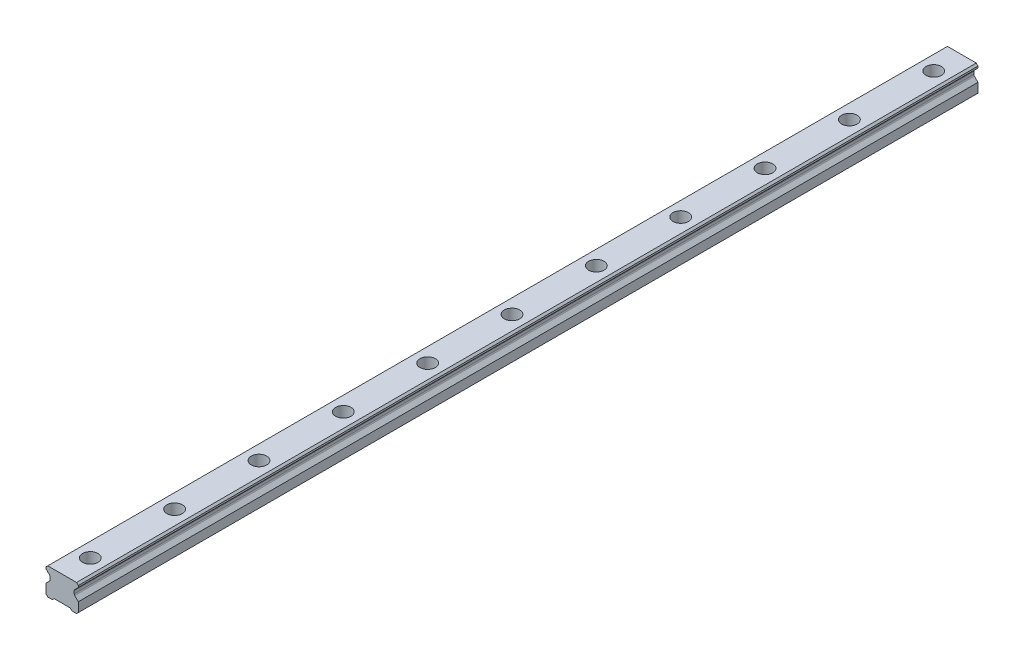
from build123d import *

# Parameters (mm, degrees)
SKETCH1_W           = 23
SKETCH1_H           = 19.2
BOSS_EXTRUDE1_DEPTH = 320
CUT_EXTRUDE1_DEPTH  = 641.391200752
CHAMFER1_SIZE       = 1.25
FILLET1_R           = 1.25
CUT_EXTRUDE2_DEPTH  = 641.391200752
SKETCH4_R           = 5.5
SKETCH4_R_2         = 3.5
CUT_EXTRUDE3_DEPTH  = 9
SKETCH4_2_R         = 3.5
CUT_EXTRUDE4_DEPTH  = 321.781685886
LPATTERN1_COUNT     = 11
LPATTERN1_PITCH     = 60


with BuildPart() as part:
    # Sketch1 → Boss-Extrude1 (new, symmetric)
    with BuildSketch(Plane.XY):
        with Locations((0, 9.6)):
            Rectangle(SKETCH1_W, SKETCH1_H)
    extrude(amount=BOSS_EXTRUDE1_DEPTH, both=True)

    # Sketch2 → Cut-Extrude1 (cut, through all)
    with BuildSketch(Plane.XY.offset(320)):
        Polygon((-11.5, 16.7), (-11.5, 7.95), (-8.583333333, 10.866666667), (-8.583333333, 13.783333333), align=None)
        Polygon((8.583333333, 13.783333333), (11.5, 16.7), (11.5, 7.95), (8.583333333, 10.866666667), align=None)
    extrude(amount=-CUT_EXTRUDE1_DEPTH, mode=Mode.SUBTRACT)

    # Chamfer1
    chamfer1_edges = [part.edges().sort_by_distance(p)[0] for p in [
        (-11.5, 19.2, 0),
        (11.5, 19.2, 0),
        (11.5, 0, 0),
        (-11.5, 0, 0),
    ]]
    chamfer(chamfer1_edges, length=CHAMFER1_SIZE)

    # Fillet1
    fillet1_edges = [part.edges().sort_by_distance(p)[0] for p in [
        (-8.583333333, 13.783333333, 0),
        (-8.583333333, 10.866666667, 0),
        (8.583333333, 10.866666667, 0),
        (8.583333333, 13.783333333, 0),
    ]]
    fillet(fillet1_edges, radius=FILLET1_R)

    # Sketch3 → Cut-Extrude2 (cut, through all)
    with BuildSketch(Plane.XY.offset(320)):
        Polygon((-7, 0), (-5.75, 1.25), (5.75, 1.25), (7, 0), align=None)
    extrude(amount=-CUT_EXTRUDE2_DEPTH, mode=Mode.SUBTRACT)

    # Sketch4 → Cut-Extrude3 (cut)
    with BuildSketch(Plane(origin=(0, 19.2, 0), x_dir=(1, 0, 0), z_dir=(0, 1, 0))):
        with Locations(Location((0, -300, 0), (0, 0, 270))):
            Circle(SKETCH4_R)
        with Locations(Location((0, -300, 0), (0, 0, 270))):
            Circle(SKETCH4_R_2, mode=Mode.SUBTRACT)
    cut_extrude3 = extrude(amount=-CUT_EXTRUDE3_DEPTH, mode=Mode.SUBTRACT)

    # Sketch4_2 → Cut-Extrude4 (cut, through all)
    with BuildSketch(Plane(origin=(0, 19.2, 0), x_dir=(1, 0, 0), z_dir=(0, 1, 0))):
        with Locations(Location((0, -300, 0), (0, 0, 270))):
            Circle(SKETCH4_2_R)
    cut_extrude4 = extrude(amount=-CUT_EXTRUDE4_DEPTH, mode=Mode.SUBTRACT)

    # LPattern1: Cut-Extrude3, Cut-Extrude4 ×11
    with Locations(*[(0, 0, -i * LPATTERN1_PITCH) for i in range(1, LPATTERN1_COUNT)]):
        add(cut_extrude3, mode=Mode.SUBTRACT)
        add(cut_extrude4, mode=Mode.SUBTRACT)


solid = part.part
